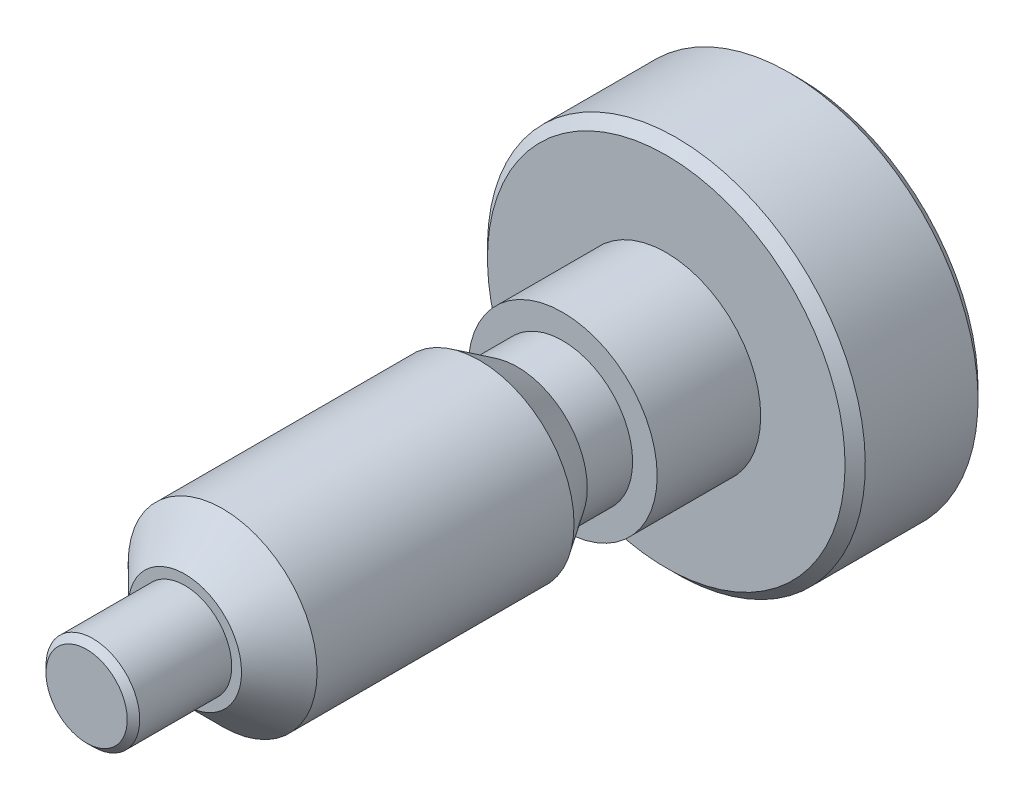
ISO-10303-21;
HEADER;
FILE_DESCRIPTION(('STEP AP214'),'2;1');
FILE_NAME('part.step','',(''),(''),'','','');
FILE_SCHEMA(('AUTOMOTIVE_DESIGN { 1 0 10303 214 1 1 1 1 }'));
ENDSEC;
DATA;
#1=APPLICATION_CONTEXT('core data for automotive mechanical design processes');
#2=APPLICATION_PROTOCOL_DEFINITION('international standard','automotive_design',2000,#1);
#3=PRODUCT_CONTEXT('',#1,'mechanical');
#4=PRODUCT('Part','Part','',(#3));
#5=PRODUCT_RELATED_PRODUCT_CATEGORY('part','',(#4));
#6=PRODUCT_DEFINITION_FORMATION('','',#4);
#7=PRODUCT_DEFINITION_CONTEXT('part definition',#1,'design');
#8=PRODUCT_DEFINITION('design','',#6,#7);
#9=PRODUCT_DEFINITION_SHAPE('','',#8);
#10=(LENGTH_UNIT() NAMED_UNIT(*) SI_UNIT(.MILLI.,.METRE.));
#11=(NAMED_UNIT(*) PLANE_ANGLE_UNIT() SI_UNIT($,.RADIAN.));
#12=(NAMED_UNIT(*) SI_UNIT($,.STERADIAN.) SOLID_ANGLE_UNIT());
#13=UNCERTAINTY_MEASURE_WITH_UNIT(LENGTH_MEASURE(1.E-05),#10,'distance_accuracy_value','');
#14=(GEOMETRIC_REPRESENTATION_CONTEXT(3) GLOBAL_UNCERTAINTY_ASSIGNED_CONTEXT((#13)) GLOBAL_UNIT_ASSIGNED_CONTEXT((#10,
#11,#12)) REPRESENTATION_CONTEXT('',''));
#15=CARTESIAN_POINT('',(0.,0.,0.));
#16=DIRECTION('',(0.,0.,1.));
#17=DIRECTION('',(1.,0.,0.));
#18=AXIS2_PLACEMENT_3D('',#15,#16,#17);
#19=CARTESIAN_POINT('',(0.,0.,11.9761));
#20=DIRECTION('',(0.,0.,1.));
#21=DIRECTION('',(1.,0.,0.));
#22=AXIS2_PLACEMENT_3D('',#19,#20,#21);
#23=CYLINDRICAL_SURFACE('',#22,1.5748);
#24=CARTESIAN_POINT('',(0.,0.,0.419099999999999));
#25=DIRECTION('',(0.,0.,1.));
#26=DIRECTION('',(1.,0.,0.));
#27=AXIS2_PLACEMENT_3D('',#24,#25,#26);
#28=CIRCLE('',#27,1.5748);
#29=CARTESIAN_POINT('',(1.5748,0.,0.419099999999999));
#30=VERTEX_POINT('',#29);
#31=EDGE_CURVE('E75',#30,#30,#28,.T.);
#32=ORIENTED_EDGE('',*,*,#31,.F.);
#33=EDGE_LOOP('',(#32));
#34=FACE_BOUND('',#33,.T.);
#35=CARTESIAN_POINT('',(0.,0.,8.6741));
#36=DIRECTION('',(0.,0.,1.));
#37=DIRECTION('',(1.,0.,0.));
#38=AXIS2_PLACEMENT_3D('',#35,#36,#37);
#39=CIRCLE('',#38,1.5748);
#40=CARTESIAN_POINT('',(1.5748,0.,8.6741));
#41=VERTEX_POINT('',#40);
#42=EDGE_CURVE('E11',#41,#41,#39,.T.);
#43=ORIENTED_EDGE('',*,*,#42,.T.);
#44=EDGE_LOOP('',(#43));
#45=FACE_BOUND('',#44,.T.);
#46=ADVANCED_FACE('F50',(#34,#45),#23,.F.);
#47=CARTESIAN_POINT('',(0.,1.5748,8.6741));
#48=DIRECTION('',(0.,0.,-1.));
#49=DIRECTION('',(-1.,0.,0.));
#50=AXIS2_PLACEMENT_3D('',#47,#48,#49);
#51=PLANE('',#50);
#52=ORIENTED_EDGE('',*,*,#42,.F.);
#53=EDGE_LOOP('',(#52));
#54=FACE_BOUND('',#53,.T.);
#55=CARTESIAN_POINT('',(0.,0.,8.6741));
#56=DIRECTION('',(0.,0.,1.));
#57=DIRECTION('',(1.,0.,0.));
#58=AXIS2_PLACEMENT_3D('',#55,#56,#57);
#59=CIRCLE('',#58,1.905);
#60=CARTESIAN_POINT('',(1.905,0.,8.6741));
#61=VERTEX_POINT('',#60);
#62=EDGE_CURVE('E56',#61,#61,#59,.T.);
#63=ORIENTED_EDGE('',*,*,#62,.T.);
#64=EDGE_LOOP('',(#63));
#65=FACE_BOUND('',#64,.T.);
#66=ADVANCED_FACE('F82',(#54,#65),#51,.F.);
#67=CARTESIAN_POINT('',(0.,0.,7.4041));
#68=DIRECTION('',(0.,0.,-1.));
#69=DIRECTION('',(-1.,0.,0.));
#70=AXIS2_PLACEMENT_3D('',#67,#68,#69);
#71=CONICAL_SURFACE('',#70,3.175,0.785398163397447);
#72=ORIENTED_EDGE('',*,*,#62,.F.);
#73=EDGE_LOOP('',(#72));
#74=FACE_BOUND('',#73,.T.);
#75=CARTESIAN_POINT('',(0.,0.,7.4041));
#76=DIRECTION('',(0.,0.,1.));
#77=DIRECTION('',(1.,0.,0.));
#78=AXIS2_PLACEMENT_3D('',#75,#76,#77);
#79=CIRCLE('',#78,3.175);
#80=CARTESIAN_POINT('',(3.175,0.,7.4041));
#81=VERTEX_POINT('',#80);
#82=EDGE_CURVE('E60',#81,#81,#79,.T.);
#83=ORIENTED_EDGE('',*,*,#82,.T.);
#84=EDGE_LOOP('',(#83));
#85=FACE_BOUND('',#84,.T.);
#86=ADVANCED_FACE('F86',(#74,#85),#71,.T.);
#87=CARTESIAN_POINT('',(0.,0.,11.9761));
#88=DIRECTION('',(0.,0.,1.));
#89=DIRECTION('',(1.,0.,0.));
#90=AXIS2_PLACEMENT_3D('',#87,#88,#89);
#91=CYLINDRICAL_SURFACE('',#90,3.175);
#92=ORIENTED_EDGE('',*,*,#82,.F.);
#93=EDGE_LOOP('',(#92));
#94=FACE_BOUND('',#93,.T.);
#95=CARTESIAN_POINT('',(0.,0.,-1.2319));
#96=DIRECTION('',(0.,0.,1.));
#97=DIRECTION('',(1.,0.,0.));
#98=AXIS2_PLACEMENT_3D('',#95,#96,#97);
#99=CIRCLE('',#98,3.175);
#100=CARTESIAN_POINT('',(3.175,0.,-1.2319));
#101=VERTEX_POINT('',#100);
#102=EDGE_CURVE('E64',#101,#101,#99,.T.);
#103=ORIENTED_EDGE('',*,*,#102,.T.);
#104=EDGE_LOOP('',(#103));
#105=FACE_BOUND('',#104,.T.);
#106=ADVANCED_FACE('F91',(#94,#105),#91,.T.);
#107=CARTESIAN_POINT('',(0.,0.,-2.5019));
#108=DIRECTION('',(0.,0.,1.));
#109=DIRECTION('',(1.,0.,0.));
#110=AXIS2_PLACEMENT_3D('',#107,#108,#109);
#111=CONICAL_SURFACE('',#110,2.3495,0.576375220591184);
#112=ORIENTED_EDGE('',*,*,#102,.F.);
#113=EDGE_LOOP('',(#112));
#114=FACE_BOUND('',#113,.T.);
#115=CARTESIAN_POINT('',(0.,0.,-2.5019));
#116=DIRECTION('',(0.,0.,1.));
#117=DIRECTION('',(1.,0.,0.));
#118=AXIS2_PLACEMENT_3D('',#115,#116,#117);
#119=CIRCLE('',#118,2.3495);
#120=CARTESIAN_POINT('',(2.3495,0.,-2.5019));
#121=VERTEX_POINT('',#120);
#122=EDGE_CURVE('E69',#121,#121,#119,.T.);
#123=ORIENTED_EDGE('',*,*,#122,.T.);
#124=EDGE_LOOP('',(#123));
#125=FACE_BOUND('',#124,.T.);
#126=ADVANCED_FACE('F97',(#114,#125),#111,.T.);
#127=CARTESIAN_POINT('',(0.,0.,11.9761));
#128=DIRECTION('',(0.,0.,1.));
#129=DIRECTION('',(1.,0.,0.));
#130=AXIS2_PLACEMENT_3D('',#127,#128,#129);
#131=CYLINDRICAL_SURFACE('',#130,2.3495);
#132=ORIENTED_EDGE('',*,*,#122,.F.);
#133=EDGE_LOOP('',(#132));
#134=FACE_BOUND('',#133,.T.);
#135=CARTESIAN_POINT('',(0.,0.,-4.0259));
#136=DIRECTION('',(0.,0.,1.));
#137=DIRECTION('',(1.,0.,0.));
#138=AXIS2_PLACEMENT_3D('',#135,#136,#137);
#139=CIRCLE('',#138,2.3495);
#140=CARTESIAN_POINT('',(2.3495,0.,-4.0259));
#141=VERTEX_POINT('',#140);
#142=EDGE_CURVE('E72',#141,#141,#139,.T.);
#143=ORIENTED_EDGE('',*,*,#142,.T.);
#144=EDGE_LOOP('',(#143));
#145=FACE_BOUND('',#144,.T.);
#146=ADVANCED_FACE('F101',(#134,#145),#131,.T.);
#147=CARTESIAN_POINT('',(0.,0.,-4.0259));
#148=DIRECTION('',(0.,0.,1.));
#149=DIRECTION('',(1.,0.,0.));
#150=AXIS2_PLACEMENT_3D('',#147,#148,#149);
#151=PLANE('',#150);
#152=ORIENTED_EDGE('',*,*,#142,.F.);
#153=EDGE_LOOP('',(#152));
#154=FACE_BOUND('',#153,.T.);
#155=ADVANCED_FACE('F105',(#154),#151,.F.);
#156=CARTESIAN_POINT('',(0.,1.5748,0.419099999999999));
#157=DIRECTION('',(0.,0.,-1.));
#158=DIRECTION('',(-1.,0.,0.));
#159=AXIS2_PLACEMENT_3D('',#156,#157,#158);
#160=PLANE('',#159);
#161=ORIENTED_EDGE('',*,*,#31,.T.);
#162=EDGE_LOOP('',(#161));
#163=FACE_BOUND('',#162,.T.);
#164=ADVANCED_FACE('F79',(#163),#160,.F.);
#165=CLOSED_SHELL('',(#46,#66,#86,#106,#126,#146,#155,#164));
#166=MANIFOLD_SOLID_BREP('B2',#165);
#167=CARTESIAN_POINT('',(0.,0.,11.9761));
#168=DIRECTION('',(0.,0.,1.));
#169=DIRECTION('',(0.,-1.,0.));
#170=AXIS2_PLACEMENT_3D('',#167,#168,#169);
#171=PLANE('',#170);
#172=CARTESIAN_POINT('',(0.,0.,11.9761));
#173=DIRECTION('',(0.,0.,1.));
#174=DIRECTION('',(0.,-1.,0.));
#175=AXIS2_PLACEMENT_3D('',#172,#173,#174);
#176=CIRCLE('',#175,1.36482666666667);
#177=CARTESIAN_POINT('',(0.,-1.36482666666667,11.9761));
#178=VERTEX_POINT('',#177);
#179=EDGE_CURVE('E49',#178,#178,#176,.T.);
#180=ORIENTED_EDGE('',*,*,#179,.T.);
#181=EDGE_LOOP('',(#180));
#182=FACE_BOUND('',#181,.T.);
#183=ADVANCED_FACE('F157',(#182),#171,.T.);
#184=CARTESIAN_POINT('',(0.,0.,0.419099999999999));
#185=DIRECTION('',(0.,0.,-1.));
#186=DIRECTION('',(0.,1.,0.));
#187=AXIS2_PLACEMENT_3D('',#184,#185,#186);
#188=CYLINDRICAL_SURFACE('',#187,1.5748);
#189=CARTESIAN_POINT('',(0.,0.,11.7661266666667));
#190=DIRECTION('',(0.,0.,1.));
#191=DIRECTION('',(0.,-1.,0.));
#192=AXIS2_PLACEMENT_3D('',#189,#190,#191);
#193=CIRCLE('',#192,1.5748);
#194=CARTESIAN_POINT('',(0.,-1.5748,11.7661266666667));
#195=VERTEX_POINT('',#194);
#196=EDGE_CURVE('E164',#195,#195,#193,.F.);
#197=ORIENTED_EDGE('',*,*,#196,.T.);
#198=EDGE_LOOP('',(#197));
#199=FACE_BOUND('',#198,.T.);
#200=CARTESIAN_POINT('',(0.,0.,0.419099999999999));
#201=DIRECTION('',(0.,0.,-1.));
#202=DIRECTION('',(0.,1.,0.));
#203=AXIS2_PLACEMENT_3D('',#200,#201,#202);
#204=CIRCLE('',#203,1.5748);
#205=CARTESIAN_POINT('',(0.,1.5748,0.419099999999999));
#206=VERTEX_POINT('',#205);
#207=EDGE_CURVE('E168',#206,#206,#204,.T.);
#208=ORIENTED_EDGE('',*,*,#207,.F.);
#209=EDGE_LOOP('',(#208));
#210=FACE_BOUND('',#209,.T.);
#211=ADVANCED_FACE('F177',(#199,#210),#188,.T.);
#212=CARTESIAN_POINT('',(0.,1.5748,0.419099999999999));
#213=DIRECTION('',(0.,0.,-1.));
#214=DIRECTION('',(0.,1.,0.));
#215=AXIS2_PLACEMENT_3D('',#212,#213,#214);
#216=PLANE('',#215);
#217=ORIENTED_EDGE('',*,*,#207,.T.);
#218=EDGE_LOOP('',(#217));
#219=FACE_BOUND('',#218,.T.);
#220=ADVANCED_FACE('F175',(#219),#216,.T.);
#221=CARTESIAN_POINT('',(0.,0.,11.7661266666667));
#222=DIRECTION('',(0.,0.,-1.));
#223=DIRECTION('',(0.,1.,0.));
#224=AXIS2_PLACEMENT_3D('',#221,#222,#223);
#225=CONICAL_SURFACE('',#224,1.5748,0.785398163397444);
#226=ORIENTED_EDGE('',*,*,#179,.F.);
#227=EDGE_LOOP('',(#226));
#228=FACE_BOUND('',#227,.T.);
#229=ORIENTED_EDGE('',*,*,#196,.F.);
#230=EDGE_LOOP('',(#229));
#231=FACE_BOUND('',#230,.T.);
#232=ADVANCED_FACE('F159',(#228,#231),#225,.T.);
#233=CLOSED_SHELL('',(#183,#211,#220,#232));
#234=MANIFOLD_SOLID_BREP('B6',#233);
#235=CARTESIAN_POINT('',(0.,0.,-11.9761));
#236=DIRECTION('',(0.,0.,-1.));
#237=DIRECTION('',(0.,1.,0.));
#238=AXIS2_PLACEMENT_3D('',#235,#236,#237);
#239=CYLINDRICAL_SURFACE('',#238,3.175);
#240=CARTESIAN_POINT('',(0.,0.,-4.0259));
#241=DIRECTION('',(0.,0.,-1.));
#242=DIRECTION('',(0.,1.,0.));
#243=AXIS2_PLACEMENT_3D('',#240,#241,#242);
#244=CIRCLE('',#243,3.175);
#245=CARTESIAN_POINT('',(0.,3.175,-4.0259));
#246=VERTEX_POINT('',#245);
#247=EDGE_CURVE('E156',#246,#246,#244,.T.);
#248=ORIENTED_EDGE('',*,*,#247,.T.);
#249=EDGE_LOOP('',(#248));
#250=FACE_BOUND('',#249,.T.);
#251=CARTESIAN_POINT('',(0.,0.,-7.5057));
#252=DIRECTION('',(0.,0.,-1.));
#253=DIRECTION('',(0.,1.,0.));
#254=AXIS2_PLACEMENT_3D('',#251,#252,#253);
#255=CIRCLE('',#254,3.175);
#256=CARTESIAN_POINT('',(0.,3.175,-7.5057));
#257=VERTEX_POINT('',#256);
#258=EDGE_CURVE('E232',#257,#257,#255,.T.);
#259=ORIENTED_EDGE('',*,*,#258,.F.);
#260=EDGE_LOOP('',(#259));
#261=FACE_BOUND('',#260,.T.);
#262=ADVANCED_FACE('F205',(#250,#261),#239,.T.);
#263=CARTESIAN_POINT('',(0.,0.,-4.0259));
#264=DIRECTION('',(0.,0.,1.));
#265=DIRECTION('',(0.,-1.,0.));
#266=AXIS2_PLACEMENT_3D('',#263,#264,#265);
#267=PLANE('',#266);
#268=ORIENTED_EDGE('',*,*,#247,.F.);
#269=EDGE_LOOP('',(#268));
#270=FACE_BOUND('',#269,.T.);
#271=ADVANCED_FACE('F241',(#270),#267,.T.);
#272=CARTESIAN_POINT('',(0.,6.00927714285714,-11.9761));
#273=DIRECTION('',(0.,0.,-1.));
#274=DIRECTION('',(0.,1.,0.));
#275=AXIS2_PLACEMENT_3D('',#272,#273,#274);
#276=PLANE('',#275);
#277=CARTESIAN_POINT('',(0.,0.,-11.9761));
#278=DIRECTION('',(0.,0.,-1.));
#279=DIRECTION('',(0.,1.,0.));
#280=AXIS2_PLACEMENT_3D('',#277,#278,#279);
#281=CIRCLE('',#280,6.00927714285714);
#282=CARTESIAN_POINT('',(0.,6.00927714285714,-11.9761));
#283=VERTEX_POINT('',#282);
#284=EDGE_CURVE('E212',#283,#283,#281,.T.);
#285=ORIENTED_EDGE('',*,*,#284,.T.);
#286=EDGE_LOOP('',(#285));
#287=FACE_BOUND('',#286,.T.);
#288=ADVANCED_FACE('F245',(#287),#276,.T.);
#289=CARTESIAN_POINT('',(0.,0.,-11.9761));
#290=DIRECTION('',(0.,0.,1.));
#291=DIRECTION('',(0.,-1.,0.));
#292=AXIS2_PLACEMENT_3D('',#289,#290,#291);
#293=CONICAL_SURFACE('',#292,6.00927714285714,0.785398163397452);
#294=CARTESIAN_POINT('',(0.,0.,-11.6353771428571));
#295=DIRECTION('',(0.,0.,-1.));
#296=DIRECTION('',(0.,1.,0.));
#297=AXIS2_PLACEMENT_3D('',#294,#295,#296);
#298=CIRCLE('',#297,6.35);
#299=CARTESIAN_POINT('',(0.,6.35,-11.6353771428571));
#300=VERTEX_POINT('',#299);
#301=EDGE_CURVE('E217',#300,#300,#298,.T.);
#302=ORIENTED_EDGE('',*,*,#301,.T.);
#303=EDGE_LOOP('',(#302));
#304=FACE_BOUND('',#303,.T.);
#305=ORIENTED_EDGE('',*,*,#284,.F.);
#306=EDGE_LOOP('',(#305));
#307=FACE_BOUND('',#306,.T.);
#308=ADVANCED_FACE('F250',(#304,#307),#293,.T.);
#309=CARTESIAN_POINT('',(0.,0.,-11.9761));
#310=DIRECTION('',(0.,0.,-1.));
#311=DIRECTION('',(0.,1.,0.));
#312=AXIS2_PLACEMENT_3D('',#309,#310,#311);
#313=CYLINDRICAL_SURFACE('',#312,6.35);
#314=CARTESIAN_POINT('',(0.,0.,-7.84642285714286));
#315=DIRECTION('',(0.,0.,-1.));
#316=DIRECTION('',(0.,1.,0.));
#317=AXIS2_PLACEMENT_3D('',#314,#315,#316);
#318=CIRCLE('',#317,6.35);
#319=CARTESIAN_POINT('',(0.,6.35,-7.84642285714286));
#320=VERTEX_POINT('',#319);
#321=EDGE_CURVE('E222',#320,#320,#318,.T.);
#322=ORIENTED_EDGE('',*,*,#321,.T.);
#323=EDGE_LOOP('',(#322));
#324=FACE_BOUND('',#323,.T.);
#325=ORIENTED_EDGE('',*,*,#301,.F.);
#326=EDGE_LOOP('',(#325));
#327=FACE_BOUND('',#326,.T.);
#328=ADVANCED_FACE('F255',(#324,#327),#313,.T.);
#329=CARTESIAN_POINT('',(0.,0.,-7.84642285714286));
#330=DIRECTION('',(0.,0.,-1.));
#331=DIRECTION('',(0.,1.,0.));
#332=AXIS2_PLACEMENT_3D('',#329,#330,#331);
#333=CONICAL_SURFACE('',#332,6.35,0.785398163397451);
#334=CARTESIAN_POINT('',(0.,0.,-7.5057));
#335=DIRECTION('',(0.,0.,-1.));
#336=DIRECTION('',(0.,1.,0.));
#337=AXIS2_PLACEMENT_3D('',#334,#335,#336);
#338=CIRCLE('',#337,6.00927714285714);
#339=CARTESIAN_POINT('',(0.,6.00927714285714,-7.5057));
#340=VERTEX_POINT('',#339);
#341=EDGE_CURVE('E228',#340,#340,#338,.T.);
#342=ORIENTED_EDGE('',*,*,#341,.T.);
#343=EDGE_LOOP('',(#342));
#344=FACE_BOUND('',#343,.T.);
#345=ORIENTED_EDGE('',*,*,#321,.F.);
#346=EDGE_LOOP('',(#345));
#347=FACE_BOUND('',#346,.T.);
#348=ADVANCED_FACE('F259',(#344,#347),#333,.T.);
#349=CARTESIAN_POINT('',(0.,3.175,-7.5057));
#350=DIRECTION('',(0.,0.,1.));
#351=DIRECTION('',(0.,-1.,0.));
#352=AXIS2_PLACEMENT_3D('',#349,#350,#351);
#353=PLANE('',#352);
#354=ORIENTED_EDGE('',*,*,#258,.T.);
#355=EDGE_LOOP('',(#354));
#356=FACE_BOUND('',#355,.T.);
#357=ORIENTED_EDGE('',*,*,#341,.F.);
#358=EDGE_LOOP('',(#357));
#359=FACE_BOUND('',#358,.T.);
#360=ADVANCED_FACE('F237',(#356,#359),#353,.T.);
#361=CLOSED_SHELL('',(#262,#271,#288,#308,#328,#348,#360));
#362=MANIFOLD_SOLID_BREP('B44',#361);
#363=ADVANCED_BREP_SHAPE_REPRESENTATION('',(#18,#166,#234,#362),#14);
#364=SHAPE_DEFINITION_REPRESENTATION(#9,#363);
ENDSEC;
END-ISO-10303-21;
